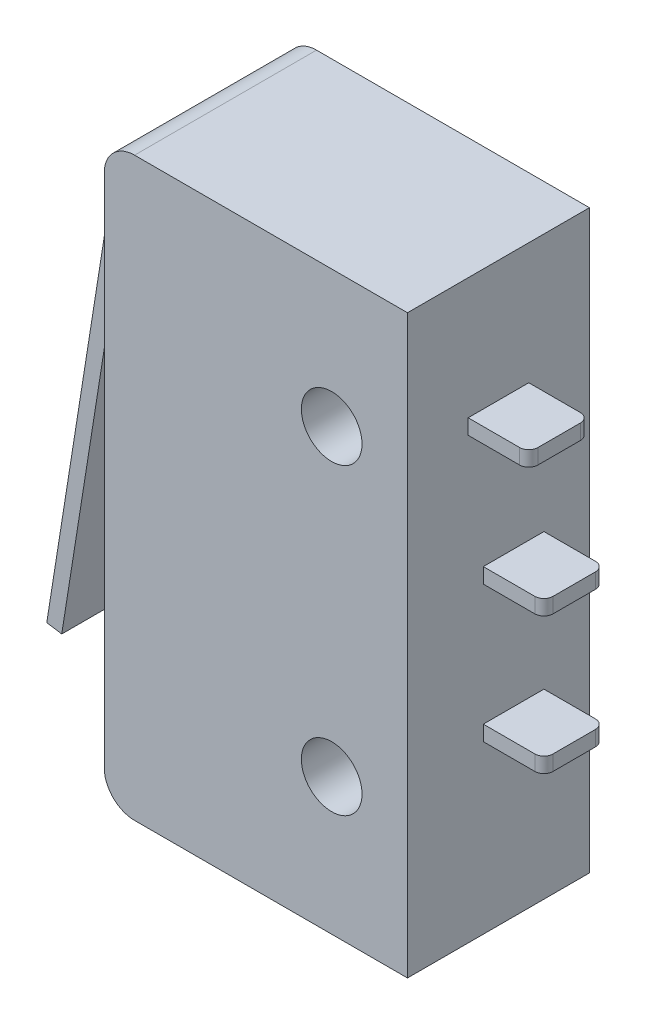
ISO-10303-21;
HEADER;
FILE_DESCRIPTION(('STEP AP214'),'2;1');
FILE_NAME('part.step','',(''),(''),'','','');
FILE_SCHEMA(('AUTOMOTIVE_DESIGN { 1 0 10303 214 1 1 1 1 }'));
ENDSEC;
DATA;
#1=APPLICATION_CONTEXT('core data for automotive mechanical design processes');
#2=APPLICATION_PROTOCOL_DEFINITION('international standard','automotive_design',2000,#1);
#3=PRODUCT_CONTEXT('',#1,'mechanical');
#4=PRODUCT('Part','Part','',(#3));
#5=PRODUCT_RELATED_PRODUCT_CATEGORY('part','',(#4));
#6=PRODUCT_DEFINITION_FORMATION('','',#4);
#7=PRODUCT_DEFINITION_CONTEXT('part definition',#1,'design');
#8=PRODUCT_DEFINITION('design','',#6,#7);
#9=PRODUCT_DEFINITION_SHAPE('','',#8);
#10=(LENGTH_UNIT() NAMED_UNIT(*) SI_UNIT(.MILLI.,.METRE.));
#11=(NAMED_UNIT(*) PLANE_ANGLE_UNIT() SI_UNIT($,.RADIAN.));
#12=(NAMED_UNIT(*) SI_UNIT($,.STERADIAN.) SOLID_ANGLE_UNIT());
#13=UNCERTAINTY_MEASURE_WITH_UNIT(LENGTH_MEASURE(1.E-05),#10,'distance_accuracy_value','');
#14=(GEOMETRIC_REPRESENTATION_CONTEXT(3) GLOBAL_UNCERTAINTY_ASSIGNED_CONTEXT((#13)) GLOBAL_UNIT_ASSIGNED_CONTEXT((#10,
#11,#12)) REPRESENTATION_CONTEXT('',''));
#15=CARTESIAN_POINT('',(0.,0.,0.));
#16=DIRECTION('',(0.,0.,1.));
#17=DIRECTION('',(1.,0.,0.));
#18=AXIS2_PLACEMENT_3D('',#15,#16,#17);
#19=CARTESIAN_POINT('',(-1.79937897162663,16.7666713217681,2.25));
#20=DIRECTION('',(-0.987688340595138,0.156434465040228,0.));
#21=DIRECTION('',(0.,0.,1.));
#22=AXIS2_PLACEMENT_3D('',#19,#20,#21);
#23=PLANE('',#22);
#24=DIRECTION('',(0.156434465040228,0.987688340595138,0.));
#25=VECTOR('',#24,1.);
#26=CARTESIAN_POINT('',(-1.79937897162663,16.7666713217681,3.75));
#27=LINE('',#26,#25);
#28=CARTESIAN_POINT('',(-4.14589594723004,1.95134621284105,3.74999999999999));
#29=VERTEX_POINT('',#28);
#30=CARTESIAN_POINT('',(-2.16521922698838,14.4568468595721,3.75));
#31=VERTEX_POINT('',#30);
#32=EDGE_CURVE('E46',#29,#31,#27,.T.);
#33=ORIENTED_EDGE('',*,*,#32,.T.);
#34=DIRECTION('',(0.,0.,-1.));
#35=VECTOR('',#34,1.);
#36=CARTESIAN_POINT('',(-2.16521922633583,14.4568468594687,2.25));
#37=LINE('',#36,#35);
#38=CARTESIAN_POINT('',(-2.16521922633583,14.4568468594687,2.25));
#39=VERTEX_POINT('',#38);
#40=EDGE_CURVE('E119',#31,#39,#37,.T.);
#41=ORIENTED_EDGE('',*,*,#40,.T.);
#42=DIRECTION('',(-0.156434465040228,-0.987688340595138,0.));
#43=VECTOR('',#42,1.);
#44=CARTESIAN_POINT('',(-1.79937897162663,16.7666713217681,2.25));
#45=LINE('',#44,#43);
#46=CARTESIAN_POINT('',(-4.14589594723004,1.95134621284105,2.24999999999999));
#47=VERTEX_POINT('',#46);
#48=EDGE_CURVE('E138',#39,#47,#45,.T.);
#49=ORIENTED_EDGE('',*,*,#48,.T.);
#50=DIRECTION('',(0.,0.,1.));
#51=VECTOR('',#50,1.);
#52=CARTESIAN_POINT('',(-4.14589594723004,1.95134621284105,3.74999999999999));
#53=LINE('',#52,#51);
#54=EDGE_CURVE('E66',#47,#29,#53,.T.);
#55=ORIENTED_EDGE('',*,*,#54,.T.);
#56=EDGE_LOOP('',(#33,#41,#49,#55));
#57=FACE_BOUND('',#56,.T.);
#58=ADVANCED_FACE('F42',(#57),#23,.T.);
#59=CARTESIAN_POINT('',(-1.79937897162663,16.7666713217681,2.25));
#60=DIRECTION('',(0.,0.,1.));
#61=DIRECTION('',(0.156434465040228,0.987688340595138,0.));
#62=AXIS2_PLACEMENT_3D('',#59,#60,#61);
#63=PLANE('',#62);
#64=DIRECTION('',(-0.987688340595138,0.156434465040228,0.));
#65=VECTOR('',#64,1.);
#66=CARTESIAN_POINT('',(-2.16521922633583,14.4568468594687,2.25));
#67=LINE('',#66,#65);
#68=CARTESIAN_POINT('',(-1.67137505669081,14.378629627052,2.25));
#69=VERTEX_POINT('',#68);
#70=EDGE_CURVE('E13',#69,#39,#67,.T.);
#71=ORIENTED_EDGE('',*,*,#70,.F.);
#72=DIRECTION('',(-0.156434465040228,-0.987688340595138,0.));
#73=VECTOR('',#72,1.);
#74=CARTESIAN_POINT('',(-1.30553480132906,16.688454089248,2.25));
#75=LINE('',#74,#73);
#76=CARTESIAN_POINT('',(-3.65205177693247,1.87312898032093,2.24999999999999));
#77=VERTEX_POINT('',#76);
#78=EDGE_CURVE('E143',#69,#77,#75,.T.);
#79=ORIENTED_EDGE('',*,*,#78,.T.);
#80=DIRECTION('',(0.987688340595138,-0.156434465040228,0.));
#81=VECTOR('',#80,1.);
#82=CARTESIAN_POINT('',(-4.14589594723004,1.95134621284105,2.24999999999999));
#83=LINE('',#82,#81);
#84=EDGE_CURVE('E157',#47,#77,#83,.T.);
#85=ORIENTED_EDGE('',*,*,#84,.F.);
#86=ORIENTED_EDGE('',*,*,#48,.F.);
#87=EDGE_LOOP('',(#71,#79,#85,#86));
#88=FACE_BOUND('',#87,.T.);
#89=ADVANCED_FACE('F44',(#88),#63,.F.);
#90=CARTESIAN_POINT('',(-4.14589594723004,1.95134621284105,3.74999999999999));
#91=DIRECTION('',(0.156434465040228,0.987688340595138,0.));
#92=DIRECTION('',(0.,0.,-1.));
#93=AXIS2_PLACEMENT_3D('',#90,#91,#92);
#94=PLANE('',#93);
#95=DIRECTION('',(0.,0.,1.));
#96=VECTOR('',#95,1.);
#97=CARTESIAN_POINT('',(-3.65205177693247,1.87312898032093,3.74999999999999));
#98=LINE('',#97,#96);
#99=CARTESIAN_POINT('',(-3.65205177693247,1.87312898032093,3.74999999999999));
#100=VERTEX_POINT('',#99);
#101=EDGE_CURVE('E139',#77,#100,#98,.T.);
#102=ORIENTED_EDGE('',*,*,#101,.T.);
#103=DIRECTION('',(0.987688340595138,-0.156434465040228,0.));
#104=VECTOR('',#103,1.);
#105=CARTESIAN_POINT('',(-4.14589594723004,1.95134621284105,3.74999999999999));
#106=LINE('',#105,#104);
#107=EDGE_CURVE('E135',#29,#100,#106,.T.);
#108=ORIENTED_EDGE('',*,*,#107,.F.);
#109=ORIENTED_EDGE('',*,*,#54,.F.);
#110=ORIENTED_EDGE('',*,*,#84,.T.);
#111=EDGE_LOOP('',(#102,#108,#109,#110));
#112=FACE_BOUND('',#111,.T.);
#113=ADVANCED_FACE('F161',(#112),#94,.F.);
#114=CARTESIAN_POINT('',(-1.79937897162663,16.7666713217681,3.75));
#115=DIRECTION('',(0.,0.,-1.));
#116=DIRECTION('',(-0.156434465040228,-0.987688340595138,0.));
#117=AXIS2_PLACEMENT_3D('',#114,#115,#116);
#118=PLANE('',#117);
#119=DIRECTION('',(0.987688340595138,-0.156434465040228,0.));
#120=VECTOR('',#119,1.);
#121=CARTESIAN_POINT('',(-2.16521922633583,14.4568468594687,3.75));
#122=LINE('',#121,#120);
#123=CARTESIAN_POINT('',(-1.67137505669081,14.378629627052,3.75));
#124=VERTEX_POINT('',#123);
#125=EDGE_CURVE('E109',#31,#124,#122,.T.);
#126=ORIENTED_EDGE('',*,*,#125,.F.);
#127=ORIENTED_EDGE('',*,*,#32,.F.);
#128=ORIENTED_EDGE('',*,*,#107,.T.);
#129=DIRECTION('',(0.156434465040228,0.987688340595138,0.));
#130=VECTOR('',#129,1.);
#131=CARTESIAN_POINT('',(-1.30553480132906,16.688454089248,3.75));
#132=LINE('',#131,#130);
#133=EDGE_CURVE('E133',#100,#124,#132,.T.);
#134=ORIENTED_EDGE('',*,*,#133,.T.);
#135=EDGE_LOOP('',(#126,#127,#128,#134));
#136=FACE_BOUND('',#135,.T.);
#137=ADVANCED_FACE('F134',(#136),#118,.F.);
#138=CARTESIAN_POINT('',(-1.30553480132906,16.688454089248,2.25));
#139=DIRECTION('',(-0.987688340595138,0.156434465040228,0.));
#140=DIRECTION('',(0.,0.,1.));
#141=AXIS2_PLACEMENT_3D('',#138,#139,#140);
#142=PLANE('',#141);
#143=DIRECTION('',(0.,0.,-1.));
#144=VECTOR('',#143,1.);
#145=CARTESIAN_POINT('',(-1.67137505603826,14.3786296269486,2.25));
#146=LINE('',#145,#144);
#147=EDGE_CURVE('E51',#124,#69,#146,.T.);
#148=ORIENTED_EDGE('',*,*,#147,.F.);
#149=ORIENTED_EDGE('',*,*,#133,.F.);
#150=ORIENTED_EDGE('',*,*,#101,.F.);
#151=ORIENTED_EDGE('',*,*,#78,.F.);
#152=EDGE_LOOP('',(#148,#149,#150,#151));
#153=FACE_BOUND('',#152,.T.);
#154=ADVANCED_FACE('F142',(#153),#142,.F.);
#155=CARTESIAN_POINT('',(0.,15.5,3.75));
#156=DIRECTION('',(-1.,0.,0.));
#157=DIRECTION('',(0.,0.,1.));
#158=AXIS2_PLACEMENT_3D('',#155,#156,#157);
#159=PLANE('',#158);
#160=DIRECTION('',(0.,0.,-1.));
#161=VECTOR('',#160,1.);
#162=CARTESIAN_POINT('',(0.,15.,3.75));
#163=LINE('',#162,#161);
#164=CARTESIAN_POINT('',(0.,15.,3.75));
#165=VERTEX_POINT('',#164);
#166=CARTESIAN_POINT('',(0.,15.,2.25));
#167=VERTEX_POINT('',#166);
#168=EDGE_CURVE('E233',#165,#167,#163,.T.);
#169=ORIENTED_EDGE('',*,*,#168,.T.);
#170=DIRECTION('',(0.,-1.,0.));
#171=VECTOR('',#170,1.);
#172=CARTESIAN_POINT('',(0.,15.5,2.25));
#173=LINE('',#172,#171);
#174=CARTESIAN_POINT('',(0.,15.5,2.25));
#175=VERTEX_POINT('',#174);
#176=EDGE_CURVE('E148',#175,#167,#173,.T.);
#177=ORIENTED_EDGE('',*,*,#176,.F.);
#178=DIRECTION('',(0.,0.,-1.));
#179=VECTOR('',#178,1.);
#180=CARTESIAN_POINT('',(0.,15.5,3.75));
#181=LINE('',#180,#179);
#182=CARTESIAN_POINT('',(0.,15.5,3.75));
#183=VERTEX_POINT('',#182);
#184=EDGE_CURVE('E225',#183,#175,#181,.T.);
#185=ORIENTED_EDGE('',*,*,#184,.F.);
#186=DIRECTION('',(0.,-1.,0.));
#187=VECTOR('',#186,1.);
#188=CARTESIAN_POINT('',(0.,15.5,3.75));
#189=LINE('',#188,#187);
#190=EDGE_CURVE('E230',#183,#165,#189,.T.);
#191=ORIENTED_EDGE('',*,*,#190,.T.);
#192=EDGE_LOOP('',(#169,#177,#185,#191));
#193=FACE_BOUND('',#192,.T.);
#194=ADVANCED_FACE('F175',(#193),#159,.F.);
#195=CARTESIAN_POINT('',(0.,15.5,2.25));
#196=DIRECTION('',(0.,1.,0.));
#197=DIRECTION('',(0.,0.,1.));
#198=AXIS2_PLACEMENT_3D('',#195,#196,#197);
#199=PLANE('',#198);
#200=DIRECTION('',(0.,0.,-1.));
#201=VECTOR('',#200,1.);
#202=CARTESIAN_POINT('',(-0.943843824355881,15.5,2.25));
#203=LINE('',#202,#201);
#204=CARTESIAN_POINT('',(-0.94384382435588,15.500000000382,3.75));
#205=VERTEX_POINT('',#204);
#206=CARTESIAN_POINT('',(-0.94384382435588,15.5000000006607,2.25));
#207=VERTEX_POINT('',#206);
#208=EDGE_CURVE('E234',#205,#207,#203,.T.);
#209=ORIENTED_EDGE('',*,*,#208,.F.);
#210=DIRECTION('',(1.,0.,0.));
#211=VECTOR('',#210,1.);
#212=CARTESIAN_POINT('',(0.,15.5,3.75));
#213=LINE('',#212,#211);
#214=EDGE_CURVE('E228',#205,#183,#213,.T.);
#215=ORIENTED_EDGE('',*,*,#214,.T.);
#216=ORIENTED_EDGE('',*,*,#184,.T.);
#217=DIRECTION('',(-1.,0.,0.));
#218=VECTOR('',#217,1.);
#219=CARTESIAN_POINT('',(0.,15.5,2.25));
#220=LINE('',#219,#218);
#221=EDGE_CURVE('E222',#175,#207,#220,.T.);
#222=ORIENTED_EDGE('',*,*,#221,.T.);
#223=EDGE_LOOP('',(#209,#215,#216,#222));
#224=FACE_BOUND('',#223,.T.);
#225=ADVANCED_FACE('F179',(#224),#199,.T.);
#226=CARTESIAN_POINT('',(0.,15.5,3.75));
#227=DIRECTION('',(0.,0.,-1.));
#228=DIRECTION('',(-1.,0.,0.));
#229=AXIS2_PLACEMENT_3D('',#226,#227,#228);
#230=PLANE('',#229);
#231=ORIENTED_EDGE('',*,*,#214,.F.);
#232=DIRECTION('',(0.,-1.,0.));
#233=VECTOR('',#232,1.);
#234=CARTESIAN_POINT('',(-0.943843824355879,15.5,3.75));
#235=LINE('',#234,#233);
#236=CARTESIAN_POINT('',(-0.94384382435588,15.,3.75));
#237=VERTEX_POINT('',#236);
#238=EDGE_CURVE('E217',#205,#237,#235,.T.);
#239=ORIENTED_EDGE('',*,*,#238,.T.);
#240=DIRECTION('',(1.,0.,0.));
#241=VECTOR('',#240,1.);
#242=CARTESIAN_POINT('',(0.,15.,3.75));
#243=LINE('',#242,#241);
#244=EDGE_CURVE('E214',#237,#165,#243,.T.);
#245=ORIENTED_EDGE('',*,*,#244,.T.);
#246=ORIENTED_EDGE('',*,*,#190,.F.);
#247=EDGE_LOOP('',(#231,#239,#245,#246));
#248=FACE_BOUND('',#247,.T.);
#249=ADVANCED_FACE('F185',(#248),#230,.F.);
#250=CARTESIAN_POINT('',(0.,15.,2.25));
#251=DIRECTION('',(0.,1.,0.));
#252=DIRECTION('',(0.,0.,1.));
#253=AXIS2_PLACEMENT_3D('',#250,#251,#252);
#254=PLANE('',#253);
#255=ORIENTED_EDGE('',*,*,#244,.F.);
#256=DIRECTION('',(0.,0.,-1.));
#257=VECTOR('',#256,1.);
#258=CARTESIAN_POINT('',(-0.943843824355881,15.,2.25));
#259=LINE('',#258,#257);
#260=CARTESIAN_POINT('',(-0.94384382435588,15.0000000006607,2.25));
#261=VERTEX_POINT('',#260);
#262=EDGE_CURVE('E127',#237,#261,#259,.T.);
#263=ORIENTED_EDGE('',*,*,#262,.T.);
#264=DIRECTION('',(-1.,0.,0.));
#265=VECTOR('',#264,1.);
#266=CARTESIAN_POINT('',(0.,15.,2.25));
#267=LINE('',#266,#265);
#268=EDGE_CURVE('E209',#167,#261,#267,.T.);
#269=ORIENTED_EDGE('',*,*,#268,.F.);
#270=ORIENTED_EDGE('',*,*,#168,.F.);
#271=EDGE_LOOP('',(#255,#263,#269,#270));
#272=FACE_BOUND('',#271,.T.);
#273=ADVANCED_FACE('F195',(#272),#254,.F.);
#274=CARTESIAN_POINT('',(0.,15.5,2.25));
#275=DIRECTION('',(0.,0.,1.));
#276=DIRECTION('',(1.,0.,0.));
#277=AXIS2_PLACEMENT_3D('',#274,#275,#276);
#278=PLANE('',#277);
#279=ORIENTED_EDGE('',*,*,#268,.T.);
#280=DIRECTION('',(0.,1.,0.));
#281=VECTOR('',#280,1.);
#282=CARTESIAN_POINT('',(-0.943843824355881,15.5,2.25));
#283=LINE('',#282,#281);
#284=EDGE_CURVE('E210',#261,#207,#283,.T.);
#285=ORIENTED_EDGE('',*,*,#284,.T.);
#286=ORIENTED_EDGE('',*,*,#221,.F.);
#287=ORIENTED_EDGE('',*,*,#176,.T.);
#288=EDGE_LOOP('',(#279,#285,#286,#287));
#289=FACE_BOUND('',#288,.T.);
#290=ADVANCED_FACE('F198',(#289),#278,.F.);
#291=CARTESIAN_POINT('',(-0.943843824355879,14.2633999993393,3.75));
#292=DIRECTION('',(0.,0.,1.));
#293=DIRECTION('',(1.,0.,0.));
#294=AXIS2_PLACEMENT_3D('',#291,#292,#293);
#295=PLANE('',#294);
#296=ORIENTED_EDGE('',*,*,#125,.T.);
#297=CARTESIAN_POINT('',(-0.943843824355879,14.2634,3.75));
#298=DIRECTION('',(0.,0.,1.));
#299=DIRECTION('',(1.,0.,0.));
#300=AXIS2_PLACEMENT_3D('',#297,#298,#299);
#301=CIRCLE('',#300,0.736600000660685);
#302=EDGE_CURVE('E112',#124,#237,#301,.F.);
#303=ORIENTED_EDGE('',*,*,#302,.T.);
#304=ORIENTED_EDGE('',*,*,#238,.F.);
#305=CARTESIAN_POINT('',(-0.943843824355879,14.2633999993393,3.75));
#306=DIRECTION('',(0.,0.,-1.));
#307=DIRECTION('',(-1.,0.,0.));
#308=AXIS2_PLACEMENT_3D('',#305,#306,#307);
#309=CIRCLE('',#308,1.2366000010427);
#310=EDGE_CURVE('E115',#31,#205,#309,.T.);
#311=ORIENTED_EDGE('',*,*,#310,.F.);
#312=EDGE_LOOP('',(#296,#303,#304,#311));
#313=FACE_BOUND('',#312,.T.);
#314=ADVANCED_FACE('F111',(#313),#295,.T.);
#315=CARTESIAN_POINT('',(-0.943843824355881,14.2633999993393,2.25));
#316=DIRECTION('',(0.,0.,-1.));
#317=DIRECTION('',(-1.,0.,0.));
#318=AXIS2_PLACEMENT_3D('',#315,#316,#317);
#319=PLANE('',#318);
#320=CARTESIAN_POINT('',(-0.943843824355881,14.2634,2.25));
#321=DIRECTION('',(0.,0.,1.));
#322=DIRECTION('',(1.,0.,0.));
#323=AXIS2_PLACEMENT_3D('',#320,#321,#322);
#324=CIRCLE('',#323,0.736600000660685);
#325=EDGE_CURVE('E129',#261,#69,#324,.T.);
#326=ORIENTED_EDGE('',*,*,#325,.T.);
#327=ORIENTED_EDGE('',*,*,#70,.T.);
#328=CARTESIAN_POINT('',(-0.943843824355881,14.2633999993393,2.25));
#329=DIRECTION('',(0.,0.,1.));
#330=DIRECTION('',(1.,0.,0.));
#331=AXIS2_PLACEMENT_3D('',#328,#329,#330);
#332=CIRCLE('',#331,1.2366000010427);
#333=EDGE_CURVE('E59',#207,#39,#332,.T.);
#334=ORIENTED_EDGE('',*,*,#333,.F.);
#335=ORIENTED_EDGE('',*,*,#284,.F.);
#336=EDGE_LOOP('',(#326,#327,#334,#335));
#337=FACE_BOUND('',#336,.T.);
#338=ADVANCED_FACE('F190',(#337),#319,.T.);
#339=CARTESIAN_POINT('',(-0.943843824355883,14.2634,0.891590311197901));
#340=DIRECTION('',(0.,0.,1.));
#341=DIRECTION('',(1.,0.,0.));
#342=AXIS2_PLACEMENT_3D('',#339,#340,#341);
#343=CYLINDRICAL_SURFACE('',#342,1.23660000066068);
#344=ORIENTED_EDGE('',*,*,#208,.T.);
#345=ORIENTED_EDGE('',*,*,#333,.T.);
#346=ORIENTED_EDGE('',*,*,#40,.F.);
#347=ORIENTED_EDGE('',*,*,#310,.T.);
#348=EDGE_LOOP('',(#344,#345,#346,#347));
#349=FACE_BOUND('',#348,.T.);
#350=ADVANCED_FACE('F205',(#349),#343,.T.);
#351=CARTESIAN_POINT('',(-0.943843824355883,14.2634,0.891590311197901));
#352=DIRECTION('',(0.,0.,1.));
#353=DIRECTION('',(1.,0.,0.));
#354=AXIS2_PLACEMENT_3D('',#351,#352,#353);
#355=CYLINDRICAL_SURFACE('',#354,0.736600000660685);
#356=ORIENTED_EDGE('',*,*,#262,.F.);
#357=ORIENTED_EDGE('',*,*,#302,.F.);
#358=ORIENTED_EDGE('',*,*,#147,.T.);
#359=ORIENTED_EDGE('',*,*,#325,.F.);
#360=EDGE_LOOP('',(#356,#357,#358,#359));
#361=FACE_BOUND('',#360,.T.);
#362=ADVANCED_FACE('F122',(#361),#355,.F.);
#363=CLOSED_SHELL('',(#58,#89,#113,#137,#154,#194,#225,#249,#273,#290,#314,#338,#350,#362));
#364=MANIFOLD_SOLID_BREP('B2',#363);
#365=CARTESIAN_POINT('',(10.,0.,6.));
#366=DIRECTION('',(-1.,0.,0.));
#367=DIRECTION('',(0.,-1.,0.));
#368=AXIS2_PLACEMENT_3D('',#365,#366,#367);
#369=PLANE('',#368);
#370=DIRECTION('',(0.,-1.,0.));
#371=VECTOR('',#370,1.);
#372=CARTESIAN_POINT('',(10.,10.5,3.5));
#373=LINE('',#372,#371);
#374=CARTESIAN_POINT('',(10.,10.5,3.5));
#375=VERTEX_POINT('',#374);
#376=CARTESIAN_POINT('',(10.,10.,3.5));
#377=VERTEX_POINT('',#376);
#378=EDGE_CURVE('E526',#375,#377,#373,.T.);
#379=ORIENTED_EDGE('',*,*,#378,.F.);
#380=DIRECTION('',(0.,0.,1.));
#381=VECTOR('',#380,1.);
#382=CARTESIAN_POINT('',(10.,10.5,3.5));
#383=LINE('',#382,#381);
#384=CARTESIAN_POINT('',(10.,10.5,1.5));
#385=VERTEX_POINT('',#384);
#386=EDGE_CURVE('E535',#385,#375,#383,.T.);
#387=ORIENTED_EDGE('',*,*,#386,.F.);
#388=DIRECTION('',(0.,1.,0.));
#389=VECTOR('',#388,1.);
#390=CARTESIAN_POINT('',(10.,10.5,1.5));
#391=LINE('',#390,#389);
#392=CARTESIAN_POINT('',(10.,10.,1.5));
#393=VERTEX_POINT('',#392);
#394=EDGE_CURVE('E532',#393,#385,#391,.T.);
#395=ORIENTED_EDGE('',*,*,#394,.F.);
#396=DIRECTION('',(0.,0.,-1.));
#397=VECTOR('',#396,1.);
#398=CARTESIAN_POINT('',(10.,10.,3.5));
#399=LINE('',#398,#397);
#400=EDGE_CURVE('E529',#377,#393,#399,.T.);
#401=ORIENTED_EDGE('',*,*,#400,.F.);
#402=EDGE_LOOP('',(#379,#387,#395,#401));
#403=FACE_BOUND('',#402,.T.);
#404=DIRECTION('',(0.,1.,0.));
#405=VECTOR('',#404,1.);
#406=CARTESIAN_POINT('',(10.,0.,0.));
#407=LINE('',#406,#405);
#408=CARTESIAN_POINT('',(10.,0.,0.));
#409=VERTEX_POINT('',#408);
#410=CARTESIAN_POINT('',(10.,19.,0.));
#411=VERTEX_POINT('',#410);
#412=EDGE_CURVE('E595',#409,#411,#407,.T.);
#413=ORIENTED_EDGE('',*,*,#412,.T.);
#414=DIRECTION('',(0.,0.,-1.));
#415=VECTOR('',#414,1.);
#416=CARTESIAN_POINT('',(10.,19.,6.));
#417=LINE('',#416,#415);
#418=CARTESIAN_POINT('',(10.,19.,6.));
#419=VERTEX_POINT('',#418);
#420=EDGE_CURVE('E610',#419,#411,#417,.T.);
#421=ORIENTED_EDGE('',*,*,#420,.F.);
#422=DIRECTION('',(0.,1.,0.));
#423=VECTOR('',#422,1.);
#424=CARTESIAN_POINT('',(10.,0.,6.));
#425=LINE('',#424,#423);
#426=CARTESIAN_POINT('',(10.,0.,6.));
#427=VERTEX_POINT('',#426);
#428=EDGE_CURVE('E605',#427,#419,#425,.T.);
#429=ORIENTED_EDGE('',*,*,#428,.F.);
#430=DIRECTION('',(0.,0.,-1.));
#431=VECTOR('',#430,1.);
#432=CARTESIAN_POINT('',(10.,0.,6.));
#433=LINE('',#432,#431);
#434=EDGE_CURVE('E613',#427,#409,#433,.T.);
#435=ORIENTED_EDGE('',*,*,#434,.T.);
#436=EDGE_LOOP('',(#413,#421,#429,#435));
#437=FACE_BOUND('',#436,.T.);
#438=DIRECTION('',(0.,-1.,0.));
#439=VECTOR('',#438,1.);
#440=CARTESIAN_POINT('',(10.,15.,4.));
#441=LINE('',#440,#439);
#442=CARTESIAN_POINT('',(10.,15.,4.));
#443=VERTEX_POINT('',#442);
#444=CARTESIAN_POINT('',(10.,14.5,4.));
#445=VERTEX_POINT('',#444);
#446=EDGE_CURVE('E552',#443,#445,#441,.T.);
#447=ORIENTED_EDGE('',*,*,#446,.F.);
#448=DIRECTION('',(0.,0.,1.));
#449=VECTOR('',#448,1.);
#450=CARTESIAN_POINT('',(10.,15.,4.));
#451=LINE('',#450,#449);
#452=CARTESIAN_POINT('',(10.,15.,2.));
#453=VERTEX_POINT('',#452);
#454=EDGE_CURVE('E561',#453,#443,#451,.T.);
#455=ORIENTED_EDGE('',*,*,#454,.F.);
#456=DIRECTION('',(0.,1.,0.));
#457=VECTOR('',#456,1.);
#458=CARTESIAN_POINT('',(10.,15.,2.));
#459=LINE('',#458,#457);
#460=CARTESIAN_POINT('',(10.,14.5,2.));
#461=VERTEX_POINT('',#460);
#462=EDGE_CURVE('E558',#461,#453,#459,.T.);
#463=ORIENTED_EDGE('',*,*,#462,.F.);
#464=DIRECTION('',(0.,0.,-1.));
#465=VECTOR('',#464,1.);
#466=CARTESIAN_POINT('',(10.,14.5,4.));
#467=LINE('',#466,#465);
#468=EDGE_CURVE('E555',#445,#461,#467,.T.);
#469=ORIENTED_EDGE('',*,*,#468,.F.);
#470=EDGE_LOOP('',(#447,#455,#463,#469));
#471=FACE_BOUND('',#470,.T.);
#472=DIRECTION('',(0.,-1.,0.));
#473=VECTOR('',#472,1.);
#474=CARTESIAN_POINT('',(10.,6.,3.5));
#475=LINE('',#474,#473);
#476=CARTESIAN_POINT('',(10.,6.,3.5));
#477=VERTEX_POINT('',#476);
#478=CARTESIAN_POINT('',(10.,5.5,3.5));
#479=VERTEX_POINT('',#478);
#480=EDGE_CURVE('E490',#477,#479,#475,.T.);
#481=ORIENTED_EDGE('',*,*,#480,.F.);
#482=DIRECTION('',(0.,0.,1.));
#483=VECTOR('',#482,1.);
#484=CARTESIAN_POINT('',(10.,6.,3.5));
#485=LINE('',#484,#483);
#486=CARTESIAN_POINT('',(10.,6.,1.5));
#487=VERTEX_POINT('',#486);
#488=EDGE_CURVE('E503',#487,#477,#485,.T.);
#489=ORIENTED_EDGE('',*,*,#488,.F.);
#490=DIRECTION('',(0.,1.,0.));
#491=VECTOR('',#490,1.);
#492=CARTESIAN_POINT('',(10.,6.,1.5));
#493=LINE('',#492,#491);
#494=CARTESIAN_POINT('',(10.,5.5,1.5));
#495=VERTEX_POINT('',#494);
#496=EDGE_CURVE('E512',#495,#487,#493,.T.);
#497=ORIENTED_EDGE('',*,*,#496,.F.);
#498=DIRECTION('',(0.,0.,-1.));
#499=VECTOR('',#498,1.);
#500=CARTESIAN_POINT('',(10.,5.5,3.5));
#501=LINE('',#500,#499);
#502=EDGE_CURVE('E506',#479,#495,#501,.T.);
#503=ORIENTED_EDGE('',*,*,#502,.F.);
#504=EDGE_LOOP('',(#481,#489,#497,#503));
#505=FACE_BOUND('',#504,.T.);
#506=ADVANCED_FACE('F325',(#403,#437,#471,#505),#369,.F.);
#507=CARTESIAN_POINT('',(0.,0.,6.));
#508=DIRECTION('',(1.,0.,0.));
#509=DIRECTION('',(0.,0.,-1.));
#510=AXIS2_PLACEMENT_3D('',#507,#508,#509);
#511=PLANE('',#510);
#512=DIRECTION('',(0.,-1.,0.));
#513=VECTOR('',#512,1.);
#514=CARTESIAN_POINT('',(0.,0.,0.));
#515=LINE('',#514,#513);
#516=CARTESIAN_POINT('',(0.,18.,0.));
#517=VERTEX_POINT('',#516);
#518=CARTESIAN_POINT('',(0.,1.,0.));
#519=VERTEX_POINT('',#518);
#520=EDGE_CURVE('E590',#517,#519,#515,.T.);
#521=ORIENTED_EDGE('',*,*,#520,.T.);
#522=DIRECTION('',(0.,0.,-1.));
#523=VECTOR('',#522,1.);
#524=CARTESIAN_POINT('',(0.,1.,6.));
#525=LINE('',#524,#523);
#526=CARTESIAN_POINT('',(0.,1.,6.));
#527=VERTEX_POINT('',#526);
#528=EDGE_CURVE('E626',#519,#527,#525,.F.);
#529=ORIENTED_EDGE('',*,*,#528,.T.);
#530=DIRECTION('',(0.,-1.,0.));
#531=VECTOR('',#530,1.);
#532=CARTESIAN_POINT('',(0.,0.,6.));
#533=LINE('',#532,#531);
#534=CARTESIAN_POINT('',(0.,18.,6.));
#535=VERTEX_POINT('',#534);
#536=EDGE_CURVE('E600',#535,#527,#533,.T.);
#537=ORIENTED_EDGE('',*,*,#536,.F.);
#538=DIRECTION('',(0.,0.,-1.));
#539=VECTOR('',#538,1.);
#540=CARTESIAN_POINT('',(0.,18.,6.));
#541=LINE('',#540,#539);
#542=EDGE_CURVE('E623',#535,#517,#541,.T.);
#543=ORIENTED_EDGE('',*,*,#542,.T.);
#544=EDGE_LOOP('',(#521,#529,#537,#543));
#545=FACE_BOUND('',#544,.T.);
#546=ADVANCED_FACE('F327',(#545),#511,.F.);
#547=CARTESIAN_POINT('',(0.,0.,6.));
#548=DIRECTION('',(0.,1.,0.));
#549=DIRECTION('',(0.,0.,1.));
#550=AXIS2_PLACEMENT_3D('',#547,#548,#549);
#551=PLANE('',#550);
#552=DIRECTION('',(1.,0.,0.));
#553=VECTOR('',#552,1.);
#554=CARTESIAN_POINT('',(0.,0.,6.));
#555=LINE('',#554,#553);
#556=CARTESIAN_POINT('',(1.,0.,6.));
#557=VERTEX_POINT('',#556);
#558=EDGE_CURVE('E603',#557,#427,#555,.T.);
#559=ORIENTED_EDGE('',*,*,#558,.F.);
#560=DIRECTION('',(0.,0.,-1.));
#561=VECTOR('',#560,1.);
#562=CARTESIAN_POINT('',(1.,0.,6.));
#563=LINE('',#562,#561);
#564=CARTESIAN_POINT('',(1.,0.,0.));
#565=VERTEX_POINT('',#564);
#566=EDGE_CURVE('E616',#557,#565,#563,.T.);
#567=ORIENTED_EDGE('',*,*,#566,.T.);
#568=DIRECTION('',(1.,0.,0.));
#569=VECTOR('',#568,1.);
#570=CARTESIAN_POINT('',(0.,0.,0.));
#571=LINE('',#570,#569);
#572=EDGE_CURVE('E593',#565,#409,#571,.T.);
#573=ORIENTED_EDGE('',*,*,#572,.T.);
#574=ORIENTED_EDGE('',*,*,#434,.F.);
#575=EDGE_LOOP('',(#559,#567,#573,#574));
#576=FACE_BOUND('',#575,.T.);
#577=ADVANCED_FACE('F719',(#576),#551,.F.);
#578=CARTESIAN_POINT('',(0.,19.,6.));
#579=DIRECTION('',(0.,-1.,0.));
#580=DIRECTION('',(0.,0.,-1.));
#581=AXIS2_PLACEMENT_3D('',#578,#579,#580);
#582=PLANE('',#581);
#583=DIRECTION('',(-1.,0.,0.));
#584=VECTOR('',#583,1.);
#585=CARTESIAN_POINT('',(0.,19.,0.));
#586=LINE('',#585,#584);
#587=CARTESIAN_POINT('',(1.,19.,0.));
#588=VERTEX_POINT('',#587);
#589=EDGE_CURVE('E597',#411,#588,#586,.T.);
#590=ORIENTED_EDGE('',*,*,#589,.T.);
#591=DIRECTION('',(0.,0.,-1.));
#592=VECTOR('',#591,1.);
#593=CARTESIAN_POINT('',(1.,19.,6.));
#594=LINE('',#593,#592);
#595=CARTESIAN_POINT('',(1.,19.,6.));
#596=VERTEX_POINT('',#595);
#597=EDGE_CURVE('E632',#588,#596,#594,.F.);
#598=ORIENTED_EDGE('',*,*,#597,.T.);
#599=DIRECTION('',(-1.,0.,0.));
#600=VECTOR('',#599,1.);
#601=CARTESIAN_POINT('',(0.,19.,6.));
#602=LINE('',#601,#600);
#603=EDGE_CURVE('E607',#419,#596,#602,.T.);
#604=ORIENTED_EDGE('',*,*,#603,.F.);
#605=ORIENTED_EDGE('',*,*,#420,.T.);
#606=EDGE_LOOP('',(#590,#598,#604,#605));
#607=FACE_BOUND('',#606,.T.);
#608=ADVANCED_FACE('F724',(#607),#582,.F.);
#609=CARTESIAN_POINT('',(0.,19.,6.));
#610=DIRECTION('',(0.,0.,-1.));
#611=DIRECTION('',(-1.,0.,0.));
#612=AXIS2_PLACEMENT_3D('',#609,#610,#611);
#613=PLANE('',#612);
#614=CARTESIAN_POINT('',(7.5,4.5,6.));
#615=DIRECTION('',(0.,0.,1.));
#616=DIRECTION('',(1.,0.,0.));
#617=AXIS2_PLACEMENT_3D('',#614,#615,#616);
#618=CIRCLE('',#617,1.);
#619=CARTESIAN_POINT('',(8.5,4.5,6.));
#620=VERTEX_POINT('',#619);
#621=EDGE_CURVE('E578',#620,#620,#618,.T.);
#622=ORIENTED_EDGE('',*,*,#621,.F.);
#623=EDGE_LOOP('',(#622));
#624=FACE_BOUND('',#623,.T.);
#625=CARTESIAN_POINT('',(7.5,14.5,6.));
#626=DIRECTION('',(0.,0.,1.));
#627=DIRECTION('',(1.,0.,0.));
#628=AXIS2_PLACEMENT_3D('',#625,#626,#627);
#629=CIRCLE('',#628,0.999999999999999);
#630=CARTESIAN_POINT('',(8.5,14.5,6.));
#631=VERTEX_POINT('',#630);
#632=EDGE_CURVE('E584',#631,#631,#629,.T.);
#633=ORIENTED_EDGE('',*,*,#632,.F.);
#634=EDGE_LOOP('',(#633));
#635=FACE_BOUND('',#634,.T.);
#636=ORIENTED_EDGE('',*,*,#536,.T.);
#637=CARTESIAN_POINT('',(1.,1.,6.));
#638=DIRECTION('',(0.,0.,-1.));
#639=DIRECTION('',(-1.,0.,0.));
#640=AXIS2_PLACEMENT_3D('',#637,#638,#639);
#641=CIRCLE('',#640,1.);
#642=EDGE_CURVE('E630',#527,#557,#641,.F.);
#643=ORIENTED_EDGE('',*,*,#642,.T.);
#644=ORIENTED_EDGE('',*,*,#558,.T.);
#645=ORIENTED_EDGE('',*,*,#428,.T.);
#646=ORIENTED_EDGE('',*,*,#603,.T.);
#647=CARTESIAN_POINT('',(1.,18.,6.));
#648=DIRECTION('',(0.,0.,-1.));
#649=DIRECTION('',(-1.,0.,0.));
#650=AXIS2_PLACEMENT_3D('',#647,#648,#649);
#651=CIRCLE('',#650,1.);
#652=EDGE_CURVE('E628',#596,#535,#651,.F.);
#653=ORIENTED_EDGE('',*,*,#652,.T.);
#654=EDGE_LOOP('',(#636,#643,#644,#645,#646,#653));
#655=FACE_BOUND('',#654,.T.);
#656=ADVANCED_FACE('F731',(#624,#635,#655),#613,.F.);
#657=CARTESIAN_POINT('',(0.,19.,0.));
#658=DIRECTION('',(0.,0.,-1.));
#659=DIRECTION('',(-1.,0.,0.));
#660=AXIS2_PLACEMENT_3D('',#657,#658,#659);
#661=PLANE('',#660);
#662=CARTESIAN_POINT('',(7.5,4.5,0.));
#663=DIRECTION('',(0.,0.,1.));
#664=DIRECTION('',(1.,0.,0.));
#665=AXIS2_PLACEMENT_3D('',#662,#663,#664);
#666=CIRCLE('',#665,1.);
#667=CARTESIAN_POINT('',(8.5,4.5,0.));
#668=VERTEX_POINT('',#667);
#669=EDGE_CURVE('E581',#668,#668,#666,.T.);
#670=ORIENTED_EDGE('',*,*,#669,.T.);
#671=EDGE_LOOP('',(#670));
#672=FACE_BOUND('',#671,.T.);
#673=CARTESIAN_POINT('',(7.5,14.5,0.));
#674=DIRECTION('',(0.,0.,1.));
#675=DIRECTION('',(1.,0.,0.));
#676=AXIS2_PLACEMENT_3D('',#673,#674,#675);
#677=CIRCLE('',#676,0.999999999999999);
#678=CARTESIAN_POINT('',(8.5,14.5,0.));
#679=VERTEX_POINT('',#678);
#680=EDGE_CURVE('E587',#679,#679,#677,.T.);
#681=ORIENTED_EDGE('',*,*,#680,.T.);
#682=EDGE_LOOP('',(#681));
#683=FACE_BOUND('',#682,.T.);
#684=ORIENTED_EDGE('',*,*,#572,.F.);
#685=CARTESIAN_POINT('',(1.,1.,0.));
#686=DIRECTION('',(0.,0.,-1.));
#687=DIRECTION('',(-1.,0.,0.));
#688=AXIS2_PLACEMENT_3D('',#685,#686,#687);
#689=CIRCLE('',#688,1.);
#690=EDGE_CURVE('E621',#565,#519,#689,.T.);
#691=ORIENTED_EDGE('',*,*,#690,.T.);
#692=ORIENTED_EDGE('',*,*,#520,.F.);
#693=CARTESIAN_POINT('',(1.,18.,0.));
#694=DIRECTION('',(0.,0.,-1.));
#695=DIRECTION('',(-1.,0.,0.));
#696=AXIS2_PLACEMENT_3D('',#693,#694,#695);
#697=CIRCLE('',#696,1.);
#698=EDGE_CURVE('E619',#517,#588,#697,.T.);
#699=ORIENTED_EDGE('',*,*,#698,.T.);
#700=ORIENTED_EDGE('',*,*,#589,.F.);
#701=ORIENTED_EDGE('',*,*,#412,.F.);
#702=EDGE_LOOP('',(#684,#691,#692,#699,#700,#701));
#703=FACE_BOUND('',#702,.T.);
#704=ADVANCED_FACE('F745',(#672,#683,#703),#661,.T.);
#705=CARTESIAN_POINT('',(1.,1.,6.));
#706=DIRECTION('',(0.,0.,-1.));
#707=DIRECTION('',(-1.,0.,0.));
#708=AXIS2_PLACEMENT_3D('',#705,#706,#707);
#709=CYLINDRICAL_SURFACE('',#708,1.);
#710=ORIENTED_EDGE('',*,*,#642,.F.);
#711=ORIENTED_EDGE('',*,*,#528,.F.);
#712=ORIENTED_EDGE('',*,*,#690,.F.);
#713=ORIENTED_EDGE('',*,*,#566,.F.);
#714=EDGE_LOOP('',(#710,#711,#712,#713));
#715=FACE_BOUND('',#714,.T.);
#716=ADVANCED_FACE('F741',(#715),#709,.T.);
#717=CARTESIAN_POINT('',(1.,18.,6.));
#718=DIRECTION('',(0.,0.,-1.));
#719=DIRECTION('',(-1.,0.,0.));
#720=AXIS2_PLACEMENT_3D('',#717,#718,#719);
#721=CYLINDRICAL_SURFACE('',#720,1.);
#722=ORIENTED_EDGE('',*,*,#652,.F.);
#723=ORIENTED_EDGE('',*,*,#597,.F.);
#724=ORIENTED_EDGE('',*,*,#698,.F.);
#725=ORIENTED_EDGE('',*,*,#542,.F.);
#726=EDGE_LOOP('',(#722,#723,#724,#725));
#727=FACE_BOUND('',#726,.T.);
#728=ADVANCED_FACE('F751',(#727),#721,.T.);
#729=CARTESIAN_POINT('',(7.5,14.5,0.));
#730=DIRECTION('',(0.,0.,1.));
#731=DIRECTION('',(1.,0.,0.));
#732=AXIS2_PLACEMENT_3D('',#729,#730,#731);
#733=CYLINDRICAL_SURFACE('',#732,0.999999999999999);
#734=ORIENTED_EDGE('',*,*,#680,.F.);
#735=EDGE_LOOP('',(#734));
#736=FACE_BOUND('',#735,.T.);
#737=ORIENTED_EDGE('',*,*,#632,.T.);
#738=EDGE_LOOP('',(#737));
#739=FACE_BOUND('',#738,.T.);
#740=ADVANCED_FACE('F770',(#736,#739),#733,.F.);
#741=CARTESIAN_POINT('',(7.5,4.5,0.));
#742=DIRECTION('',(0.,0.,1.));
#743=DIRECTION('',(1.,0.,0.));
#744=AXIS2_PLACEMENT_3D('',#741,#742,#743);
#745=CYLINDRICAL_SURFACE('',#744,1.);
#746=ORIENTED_EDGE('',*,*,#669,.F.);
#747=EDGE_LOOP('',(#746));
#748=FACE_BOUND('',#747,.T.);
#749=ORIENTED_EDGE('',*,*,#621,.T.);
#750=EDGE_LOOP('',(#749));
#751=FACE_BOUND('',#750,.T.);
#752=ADVANCED_FACE('F773',(#748,#751),#745,.F.);
#753=CARTESIAN_POINT('',(12.,15.,4.));
#754=DIRECTION('',(0.,0.,-1.));
#755=DIRECTION('',(-1.,0.,0.));
#756=AXIS2_PLACEMENT_3D('',#753,#754,#755);
#757=PLANE('',#756);
#758=DIRECTION('',(-1.,0.,0.));
#759=VECTOR('',#758,1.);
#760=CARTESIAN_POINT('',(12.,14.5,4.));
#761=LINE('',#760,#759);
#762=CARTESIAN_POINT('',(11.7,14.5,4.));
#763=VERTEX_POINT('',#762);
#764=EDGE_CURVE('E576',#763,#445,#761,.T.);
#765=ORIENTED_EDGE('',*,*,#764,.F.);
#766=DIRECTION('',(0.,-1.,0.));
#767=VECTOR('',#766,1.);
#768=CARTESIAN_POINT('',(11.7,15.,4.));
#769=LINE('',#768,#767);
#770=CARTESIAN_POINT('',(11.7,15.,4.));
#771=VERTEX_POINT('',#770);
#772=EDGE_CURVE('E40',#763,#771,#769,.F.);
#773=ORIENTED_EDGE('',*,*,#772,.T.);
#774=DIRECTION('',(-1.,0.,0.));
#775=VECTOR('',#774,1.);
#776=CARTESIAN_POINT('',(12.,15.,4.));
#777=LINE('',#776,#775);
#778=EDGE_CURVE('E570',#771,#443,#777,.T.);
#779=ORIENTED_EDGE('',*,*,#778,.T.);
#780=ORIENTED_EDGE('',*,*,#446,.T.);
#781=EDGE_LOOP('',(#765,#773,#779,#780));
#782=FACE_BOUND('',#781,.T.);
#783=ADVANCED_FACE('F699',(#782),#757,.F.);
#784=CARTESIAN_POINT('',(12.,14.5,4.));
#785=DIRECTION('',(0.,1.,0.));
#786=DIRECTION('',(-1.,0.,0.));
#787=AXIS2_PLACEMENT_3D('',#784,#785,#786);
#788=PLANE('',#787);
#789=DIRECTION('',(-1.,0.,0.));
#790=VECTOR('',#789,1.);
#791=CARTESIAN_POINT('',(12.,14.5,2.));
#792=LINE('',#791,#790);
#793=CARTESIAN_POINT('',(11.7,14.5,2.));
#794=VERTEX_POINT('',#793);
#795=EDGE_CURVE('E574',#794,#461,#792,.T.);
#796=ORIENTED_EDGE('',*,*,#795,.F.);
#797=CARTESIAN_POINT('',(11.7,14.5,2.3));
#798=DIRECTION('',(0.,1.,0.));
#799=DIRECTION('',(-1.,0.,0.));
#800=AXIS2_PLACEMENT_3D('',#797,#798,#799);
#801=CIRCLE('',#800,0.3);
#802=CARTESIAN_POINT('',(12.,14.5,2.3));
#803=VERTEX_POINT('',#802);
#804=EDGE_CURVE('E333',#794,#803,#801,.F.);
#805=ORIENTED_EDGE('',*,*,#804,.T.);
#806=DIRECTION('',(0.,0.,-1.));
#807=VECTOR('',#806,1.);
#808=CARTESIAN_POINT('',(12.,14.5,4.));
#809=LINE('',#808,#807);
#810=CARTESIAN_POINT('',(12.,14.5,3.7));
#811=VERTEX_POINT('',#810);
#812=EDGE_CURVE('E564',#811,#803,#809,.T.);
#813=ORIENTED_EDGE('',*,*,#812,.F.);
#814=CARTESIAN_POINT('',(11.7,14.5,3.7));
#815=DIRECTION('',(0.,1.,0.));
#816=DIRECTION('',(-1.,0.,0.));
#817=AXIS2_PLACEMENT_3D('',#814,#815,#816);
#818=CIRCLE('',#817,0.3);
#819=EDGE_CURVE('E340',#811,#763,#818,.F.);
#820=ORIENTED_EDGE('',*,*,#819,.T.);
#821=ORIENTED_EDGE('',*,*,#764,.T.);
#822=ORIENTED_EDGE('',*,*,#468,.T.);
#823=EDGE_LOOP('',(#796,#805,#813,#820,#821,#822));
#824=FACE_BOUND('',#823,.T.);
#825=ADVANCED_FACE('F681',(#824),#788,.F.);
#826=CARTESIAN_POINT('',(12.,15.,2.));
#827=DIRECTION('',(0.,0.,1.));
#828=DIRECTION('',(1.,0.,0.));
#829=AXIS2_PLACEMENT_3D('',#826,#827,#828);
#830=PLANE('',#829);
#831=DIRECTION('',(-1.,0.,0.));
#832=VECTOR('',#831,1.);
#833=CARTESIAN_POINT('',(12.,15.,2.));
#834=LINE('',#833,#832);
#835=CARTESIAN_POINT('',(11.7,15.,2.));
#836=VERTEX_POINT('',#835);
#837=EDGE_CURVE('E572',#836,#453,#834,.T.);
#838=ORIENTED_EDGE('',*,*,#837,.F.);
#839=DIRECTION('',(0.,1.,0.));
#840=VECTOR('',#839,1.);
#841=CARTESIAN_POINT('',(11.7,14.5,2.));
#842=LINE('',#841,#840);
#843=EDGE_CURVE('E348',#836,#794,#842,.F.);
#844=ORIENTED_EDGE('',*,*,#843,.T.);
#845=ORIENTED_EDGE('',*,*,#795,.T.);
#846=ORIENTED_EDGE('',*,*,#462,.T.);
#847=EDGE_LOOP('',(#838,#844,#845,#846));
#848=FACE_BOUND('',#847,.T.);
#849=ADVANCED_FACE('F692',(#848),#830,.F.);
#850=CARTESIAN_POINT('',(12.,15.,4.));
#851=DIRECTION('',(0.,-1.,0.));
#852=DIRECTION('',(1.,0.,0.));
#853=AXIS2_PLACEMENT_3D('',#850,#851,#852);
#854=PLANE('',#853);
#855=DIRECTION('',(0.,0.,1.));
#856=VECTOR('',#855,1.);
#857=CARTESIAN_POINT('',(12.,15.,4.));
#858=LINE('',#857,#856);
#859=CARTESIAN_POINT('',(12.,15.,2.3));
#860=VERTEX_POINT('',#859);
#861=CARTESIAN_POINT('',(12.,15.,3.7));
#862=VERTEX_POINT('',#861);
#863=EDGE_CURVE('E567',#860,#862,#858,.T.);
#864=ORIENTED_EDGE('',*,*,#863,.F.);
#865=CARTESIAN_POINT('',(11.7,15.,2.3));
#866=DIRECTION('',(0.,-1.,0.));
#867=DIRECTION('',(1.,0.,0.));
#868=AXIS2_PLACEMENT_3D('',#865,#866,#867);
#869=CIRCLE('',#868,0.3);
#870=EDGE_CURVE('E677',#860,#836,#869,.F.);
#871=ORIENTED_EDGE('',*,*,#870,.T.);
#872=ORIENTED_EDGE('',*,*,#837,.T.);
#873=ORIENTED_EDGE('',*,*,#454,.T.);
#874=ORIENTED_EDGE('',*,*,#778,.F.);
#875=CARTESIAN_POINT('',(11.7,15.,3.7));
#876=DIRECTION('',(0.,-1.,0.));
#877=DIRECTION('',(1.,0.,0.));
#878=AXIS2_PLACEMENT_3D('',#875,#876,#877);
#879=CIRCLE('',#878,0.3);
#880=EDGE_CURVE('E675',#771,#862,#879,.F.);
#881=ORIENTED_EDGE('',*,*,#880,.T.);
#882=EDGE_LOOP('',(#864,#871,#872,#873,#874,#881));
#883=FACE_BOUND('',#882,.T.);
#884=ADVANCED_FACE('F690',(#883),#854,.F.);
#885=CARTESIAN_POINT('',(12.,14.5,4.));
#886=DIRECTION('',(1.,0.,0.));
#887=DIRECTION('',(0.,0.,-1.));
#888=AXIS2_PLACEMENT_3D('',#885,#886,#887);
#889=PLANE('',#888);
#890=ORIENTED_EDGE('',*,*,#812,.T.);
#891=DIRECTION('',(0.,1.,0.));
#892=VECTOR('',#891,1.);
#893=CARTESIAN_POINT('',(12.,15.,2.3));
#894=LINE('',#893,#892);
#895=EDGE_CURVE('E672',#803,#860,#894,.T.);
#896=ORIENTED_EDGE('',*,*,#895,.T.);
#897=ORIENTED_EDGE('',*,*,#863,.T.);
#898=DIRECTION('',(0.,-1.,0.));
#899=VECTOR('',#898,1.);
#900=CARTESIAN_POINT('',(12.,14.5,3.7));
#901=LINE('',#900,#899);
#902=EDGE_CURVE('E669',#862,#811,#901,.T.);
#903=ORIENTED_EDGE('',*,*,#902,.T.);
#904=EDGE_LOOP('',(#890,#896,#897,#903));
#905=FACE_BOUND('',#904,.T.);
#906=ADVANCED_FACE('F685',(#905),#889,.T.);
#907=CARTESIAN_POINT('',(12.,10.5,3.5));
#908=DIRECTION('',(0.,0.,-1.));
#909=DIRECTION('',(0.,1.,0.));
#910=AXIS2_PLACEMENT_3D('',#907,#908,#909);
#911=PLANE('',#910);
#912=DIRECTION('',(-1.,0.,0.));
#913=VECTOR('',#912,1.);
#914=CARTESIAN_POINT('',(12.,10.,3.5));
#915=LINE('',#914,#913);
#916=CARTESIAN_POINT('',(11.7,10.,3.5));
#917=VERTEX_POINT('',#916);
#918=EDGE_CURVE('E550',#917,#377,#915,.T.);
#919=ORIENTED_EDGE('',*,*,#918,.F.);
#920=DIRECTION('',(0.,-1.,0.));
#921=VECTOR('',#920,1.);
#922=CARTESIAN_POINT('',(11.7,10.5,3.5));
#923=LINE('',#922,#921);
#924=CARTESIAN_POINT('',(11.7,10.5,3.5));
#925=VERTEX_POINT('',#924);
#926=EDGE_CURVE('E667',#917,#925,#923,.F.);
#927=ORIENTED_EDGE('',*,*,#926,.T.);
#928=DIRECTION('',(-1.,0.,0.));
#929=VECTOR('',#928,1.);
#930=CARTESIAN_POINT('',(12.,10.5,3.5));
#931=LINE('',#930,#929);
#932=EDGE_CURVE('E544',#925,#375,#931,.T.);
#933=ORIENTED_EDGE('',*,*,#932,.T.);
#934=ORIENTED_EDGE('',*,*,#378,.T.);
#935=EDGE_LOOP('',(#919,#927,#933,#934));
#936=FACE_BOUND('',#935,.T.);
#937=ADVANCED_FACE('F786',(#936),#911,.F.);
#938=CARTESIAN_POINT('',(12.,10.,3.5));
#939=DIRECTION('',(0.,1.,0.));
#940=DIRECTION('',(-1.,0.,0.));
#941=AXIS2_PLACEMENT_3D('',#938,#939,#940);
#942=PLANE('',#941);
#943=DIRECTION('',(-1.,0.,0.));
#944=VECTOR('',#943,1.);
#945=CARTESIAN_POINT('',(12.,10.,1.5));
#946=LINE('',#945,#944);
#947=CARTESIAN_POINT('',(11.7,10.,1.5));
#948=VERTEX_POINT('',#947);
#949=EDGE_CURVE('E548',#948,#393,#946,.T.);
#950=ORIENTED_EDGE('',*,*,#949,.F.);
#951=CARTESIAN_POINT('',(11.7,10.,1.8));
#952=DIRECTION('',(0.,1.,0.));
#953=DIRECTION('',(-1.,0.,0.));
#954=AXIS2_PLACEMENT_3D('',#951,#952,#953);
#955=CIRCLE('',#954,0.3);
#956=CARTESIAN_POINT('',(12.,10.,1.8));
#957=VERTEX_POINT('',#956);
#958=EDGE_CURVE('E665',#948,#957,#955,.F.);
#959=ORIENTED_EDGE('',*,*,#958,.T.);
#960=DIRECTION('',(0.,0.,-1.));
#961=VECTOR('',#960,1.);
#962=CARTESIAN_POINT('',(12.,10.,3.5));
#963=LINE('',#962,#961);
#964=CARTESIAN_POINT('',(12.,10.,3.2));
#965=VERTEX_POINT('',#964);
#966=EDGE_CURVE('E538',#965,#957,#963,.T.);
#967=ORIENTED_EDGE('',*,*,#966,.F.);
#968=CARTESIAN_POINT('',(11.7,10.,3.2));
#969=DIRECTION('',(0.,1.,0.));
#970=DIRECTION('',(-1.,0.,0.));
#971=AXIS2_PLACEMENT_3D('',#968,#969,#970);
#972=CIRCLE('',#971,0.3);
#973=EDGE_CURVE('E663',#965,#917,#972,.F.);
#974=ORIENTED_EDGE('',*,*,#973,.T.);
#975=ORIENTED_EDGE('',*,*,#918,.T.);
#976=ORIENTED_EDGE('',*,*,#400,.T.);
#977=EDGE_LOOP('',(#950,#959,#967,#974,#975,#976));
#978=FACE_BOUND('',#977,.T.);
#979=ADVANCED_FACE('F789',(#978),#942,.F.);
#980=CARTESIAN_POINT('',(12.,10.5,1.5));
#981=DIRECTION('',(0.,0.,1.));
#982=DIRECTION('',(1.,0.,0.));
#983=AXIS2_PLACEMENT_3D('',#980,#981,#982);
#984=PLANE('',#983);
#985=DIRECTION('',(-1.,0.,0.));
#986=VECTOR('',#985,1.);
#987=CARTESIAN_POINT('',(12.,10.5,1.5));
#988=LINE('',#987,#986);
#989=CARTESIAN_POINT('',(11.7,10.5,1.5));
#990=VERTEX_POINT('',#989);
#991=EDGE_CURVE('E546',#990,#385,#988,.T.);
#992=ORIENTED_EDGE('',*,*,#991,.F.);
#993=DIRECTION('',(0.,1.,0.));
#994=VECTOR('',#993,1.);
#995=CARTESIAN_POINT('',(11.7,10.,1.5));
#996=LINE('',#995,#994);
#997=EDGE_CURVE('E661',#990,#948,#996,.F.);
#998=ORIENTED_EDGE('',*,*,#997,.T.);
#999=ORIENTED_EDGE('',*,*,#949,.T.);
#1000=ORIENTED_EDGE('',*,*,#394,.T.);
#1001=EDGE_LOOP('',(#992,#998,#999,#1000));
#1002=FACE_BOUND('',#1001,.T.);
#1003=ADVANCED_FACE('F793',(#1002),#984,.F.);
#1004=CARTESIAN_POINT('',(12.,10.5,3.5));
#1005=DIRECTION('',(0.,-1.,0.));
#1006=DIRECTION('',(1.,0.,0.));
#1007=AXIS2_PLACEMENT_3D('',#1004,#1005,#1006);
#1008=PLANE('',#1007);
#1009=DIRECTION('',(0.,0.,1.));
#1010=VECTOR('',#1009,1.);
#1011=CARTESIAN_POINT('',(12.,10.5,3.5));
#1012=LINE('',#1011,#1010);
#1013=CARTESIAN_POINT('',(12.,10.5,1.8));
#1014=VERTEX_POINT('',#1013);
#1015=CARTESIAN_POINT('',(12.,10.5,3.2));
#1016=VERTEX_POINT('',#1015);
#1017=EDGE_CURVE('E541',#1014,#1016,#1012,.T.);
#1018=ORIENTED_EDGE('',*,*,#1017,.F.);
#1019=CARTESIAN_POINT('',(11.7,10.5,1.8));
#1020=DIRECTION('',(0.,-1.,0.));
#1021=DIRECTION('',(1.,0.,0.));
#1022=AXIS2_PLACEMENT_3D('',#1019,#1020,#1021);
#1023=CIRCLE('',#1022,0.3);
#1024=EDGE_CURVE('E659',#1014,#990,#1023,.F.);
#1025=ORIENTED_EDGE('',*,*,#1024,.T.);
#1026=ORIENTED_EDGE('',*,*,#991,.T.);
#1027=ORIENTED_EDGE('',*,*,#386,.T.);
#1028=ORIENTED_EDGE('',*,*,#932,.F.);
#1029=CARTESIAN_POINT('',(11.7,10.5,3.2));
#1030=DIRECTION('',(0.,-1.,0.));
#1031=DIRECTION('',(1.,0.,0.));
#1032=AXIS2_PLACEMENT_3D('',#1029,#1030,#1031);
#1033=CIRCLE('',#1032,0.3);
#1034=EDGE_CURVE('E657',#925,#1016,#1033,.F.);
#1035=ORIENTED_EDGE('',*,*,#1034,.T.);
#1036=EDGE_LOOP('',(#1018,#1025,#1026,#1027,#1028,#1035));
#1037=FACE_BOUND('',#1036,.T.);
#1038=ADVANCED_FACE('F797',(#1037),#1008,.F.);
#1039=CARTESIAN_POINT('',(12.,10.,3.5));
#1040=DIRECTION('',(1.,0.,0.));
#1041=DIRECTION('',(0.,0.,-1.));
#1042=AXIS2_PLACEMENT_3D('',#1039,#1040,#1041);
#1043=PLANE('',#1042);
#1044=ORIENTED_EDGE('',*,*,#966,.T.);
#1045=DIRECTION('',(0.,1.,0.));
#1046=VECTOR('',#1045,1.);
#1047=CARTESIAN_POINT('',(12.,10.5,1.8));
#1048=LINE('',#1047,#1046);
#1049=EDGE_CURVE('E654',#957,#1014,#1048,.T.);
#1050=ORIENTED_EDGE('',*,*,#1049,.T.);
#1051=ORIENTED_EDGE('',*,*,#1017,.T.);
#1052=DIRECTION('',(0.,-1.,0.));
#1053=VECTOR('',#1052,1.);
#1054=CARTESIAN_POINT('',(12.,10.,3.2));
#1055=LINE('',#1054,#1053);
#1056=EDGE_CURVE('E651',#1016,#965,#1055,.T.);
#1057=ORIENTED_EDGE('',*,*,#1056,.T.);
#1058=EDGE_LOOP('',(#1044,#1050,#1051,#1057));
#1059=FACE_BOUND('',#1058,.T.);
#1060=ADVANCED_FACE('F801',(#1059),#1043,.T.);
#1061=CARTESIAN_POINT('',(12.,6.,3.5));
#1062=DIRECTION('',(0.,0.,-1.));
#1063=DIRECTION('',(-1.,0.,0.));
#1064=AXIS2_PLACEMENT_3D('',#1061,#1062,#1063);
#1065=PLANE('',#1064);
#1066=DIRECTION('',(-1.,0.,0.));
#1067=VECTOR('',#1066,1.);
#1068=CARTESIAN_POINT('',(12.,5.5,3.5));
#1069=LINE('',#1068,#1067);
#1070=CARTESIAN_POINT('',(11.7,5.5,3.5));
#1071=VERTEX_POINT('',#1070);
#1072=EDGE_CURVE('E524',#1071,#479,#1069,.T.);
#1073=ORIENTED_EDGE('',*,*,#1072,.F.);
#1074=DIRECTION('',(0.,-1.,0.));
#1075=VECTOR('',#1074,1.);
#1076=CARTESIAN_POINT('',(11.7,6.,3.5));
#1077=LINE('',#1076,#1075);
#1078=CARTESIAN_POINT('',(11.7,6.,3.5));
#1079=VERTEX_POINT('',#1078);
#1080=EDGE_CURVE('E492',#1071,#1079,#1077,.F.);
#1081=ORIENTED_EDGE('',*,*,#1080,.T.);
#1082=DIRECTION('',(-1.,0.,0.));
#1083=VECTOR('',#1082,1.);
#1084=CARTESIAN_POINT('',(12.,6.,3.5));
#1085=LINE('',#1084,#1083);
#1086=EDGE_CURVE('E486',#1079,#477,#1085,.T.);
#1087=ORIENTED_EDGE('',*,*,#1086,.T.);
#1088=ORIENTED_EDGE('',*,*,#480,.T.);
#1089=EDGE_LOOP('',(#1073,#1081,#1087,#1088));
#1090=FACE_BOUND('',#1089,.T.);
#1091=ADVANCED_FACE('F489',(#1090),#1065,.F.);
#1092=CARTESIAN_POINT('',(12.,5.5,3.5));
#1093=DIRECTION('',(0.,1.,0.));
#1094=DIRECTION('',(-1.,0.,0.));
#1095=AXIS2_PLACEMENT_3D('',#1092,#1093,#1094);
#1096=PLANE('',#1095);
#1097=DIRECTION('',(-1.,0.,0.));
#1098=VECTOR('',#1097,1.);
#1099=CARTESIAN_POINT('',(12.,5.5,1.5));
#1100=LINE('',#1099,#1098);
#1101=CARTESIAN_POINT('',(11.7,5.5,1.5));
#1102=VERTEX_POINT('',#1101);
#1103=EDGE_CURVE('E522',#1102,#495,#1100,.T.);
#1104=ORIENTED_EDGE('',*,*,#1103,.F.);
#1105=CARTESIAN_POINT('',(11.7,5.5,1.8));
#1106=DIRECTION('',(0.,1.,0.));
#1107=DIRECTION('',(-1.,0.,0.));
#1108=AXIS2_PLACEMENT_3D('',#1105,#1106,#1107);
#1109=CIRCLE('',#1108,0.3);
#1110=CARTESIAN_POINT('',(12.,5.5,1.8));
#1111=VERTEX_POINT('',#1110);
#1112=EDGE_CURVE('E648',#1102,#1111,#1109,.F.);
#1113=ORIENTED_EDGE('',*,*,#1112,.T.);
#1114=DIRECTION('',(0.,0.,-1.));
#1115=VECTOR('',#1114,1.);
#1116=CARTESIAN_POINT('',(12.,5.5,3.5));
#1117=LINE('',#1116,#1115);
#1118=CARTESIAN_POINT('',(12.,5.5,3.2));
#1119=VERTEX_POINT('',#1118);
#1120=EDGE_CURVE('E511',#1119,#1111,#1117,.T.);
#1121=ORIENTED_EDGE('',*,*,#1120,.F.);
#1122=CARTESIAN_POINT('',(11.7,5.5,3.2));
#1123=DIRECTION('',(0.,1.,0.));
#1124=DIRECTION('',(-1.,0.,0.));
#1125=AXIS2_PLACEMENT_3D('',#1122,#1123,#1124);
#1126=CIRCLE('',#1125,0.3);
#1127=EDGE_CURVE('E646',#1119,#1071,#1126,.F.);
#1128=ORIENTED_EDGE('',*,*,#1127,.T.);
#1129=ORIENTED_EDGE('',*,*,#1072,.T.);
#1130=ORIENTED_EDGE('',*,*,#502,.T.);
#1131=EDGE_LOOP('',(#1104,#1113,#1121,#1128,#1129,#1130));
#1132=FACE_BOUND('',#1131,.T.);
#1133=ADVANCED_FACE('F808',(#1132),#1096,.F.);
#1134=CARTESIAN_POINT('',(12.,6.,1.5));
#1135=DIRECTION('',(0.,0.,1.));
#1136=DIRECTION('',(1.,0.,0.));
#1137=AXIS2_PLACEMENT_3D('',#1134,#1135,#1136);
#1138=PLANE('',#1137);
#1139=DIRECTION('',(-1.,0.,0.));
#1140=VECTOR('',#1139,1.);
#1141=CARTESIAN_POINT('',(12.,6.,1.5));
#1142=LINE('',#1141,#1140);
#1143=CARTESIAN_POINT('',(11.7,6.,1.5));
#1144=VERTEX_POINT('',#1143);
#1145=EDGE_CURVE('E496',#1144,#487,#1142,.T.);
#1146=ORIENTED_EDGE('',*,*,#1145,.F.);
#1147=DIRECTION('',(0.,1.,0.));
#1148=VECTOR('',#1147,1.);
#1149=CARTESIAN_POINT('',(11.7,5.5,1.5));
#1150=LINE('',#1149,#1148);
#1151=EDGE_CURVE('E644',#1144,#1102,#1150,.F.);
#1152=ORIENTED_EDGE('',*,*,#1151,.T.);
#1153=ORIENTED_EDGE('',*,*,#1103,.T.);
#1154=ORIENTED_EDGE('',*,*,#496,.T.);
#1155=EDGE_LOOP('',(#1146,#1152,#1153,#1154));
#1156=FACE_BOUND('',#1155,.T.);
#1157=ADVANCED_FACE('F811',(#1156),#1138,.F.);
#1158=CARTESIAN_POINT('',(12.,6.,3.5));
#1159=DIRECTION('',(0.,-1.,0.));
#1160=DIRECTION('',(1.,0.,0.));
#1161=AXIS2_PLACEMENT_3D('',#1158,#1159,#1160);
#1162=PLANE('',#1161);
#1163=DIRECTION('',(0.,0.,1.));
#1164=VECTOR('',#1163,1.);
#1165=CARTESIAN_POINT('',(12.,6.,3.5));
#1166=LINE('',#1165,#1164);
#1167=CARTESIAN_POINT('',(12.,6.,1.8));
#1168=VERTEX_POINT('',#1167);
#1169=CARTESIAN_POINT('',(12.,6.,3.2));
#1170=VERTEX_POINT('',#1169);
#1171=EDGE_CURVE('E497',#1168,#1170,#1166,.T.);
#1172=ORIENTED_EDGE('',*,*,#1171,.F.);
#1173=CARTESIAN_POINT('',(11.7,6.,1.8));
#1174=DIRECTION('',(0.,-1.,0.));
#1175=DIRECTION('',(1.,0.,0.));
#1176=AXIS2_PLACEMENT_3D('',#1173,#1174,#1175);
#1177=CIRCLE('',#1176,0.3);
#1178=EDGE_CURVE('E642',#1168,#1144,#1177,.F.);
#1179=ORIENTED_EDGE('',*,*,#1178,.T.);
#1180=ORIENTED_EDGE('',*,*,#1145,.T.);
#1181=ORIENTED_EDGE('',*,*,#488,.T.);
#1182=ORIENTED_EDGE('',*,*,#1086,.F.);
#1183=CARTESIAN_POINT('',(11.7,6.,3.2));
#1184=DIRECTION('',(0.,-1.,0.));
#1185=DIRECTION('',(1.,0.,0.));
#1186=AXIS2_PLACEMENT_3D('',#1183,#1184,#1185);
#1187=CIRCLE('',#1186,0.3);
#1188=EDGE_CURVE('E640',#1079,#1170,#1187,.F.);
#1189=ORIENTED_EDGE('',*,*,#1188,.T.);
#1190=EDGE_LOOP('',(#1172,#1179,#1180,#1181,#1182,#1189));
#1191=FACE_BOUND('',#1190,.T.);
#1192=ADVANCED_FACE('F509',(#1191),#1162,.F.);
#1193=CARTESIAN_POINT('',(12.,5.5,3.5));
#1194=DIRECTION('',(1.,0.,0.));
#1195=DIRECTION('',(0.,0.,-1.));
#1196=AXIS2_PLACEMENT_3D('',#1193,#1194,#1195);
#1197=PLANE('',#1196);
#1198=ORIENTED_EDGE('',*,*,#1120,.T.);
#1199=DIRECTION('',(0.,1.,0.));
#1200=VECTOR('',#1199,1.);
#1201=CARTESIAN_POINT('',(12.,6.,1.8));
#1202=LINE('',#1201,#1200);
#1203=EDGE_CURVE('E637',#1111,#1168,#1202,.T.);
#1204=ORIENTED_EDGE('',*,*,#1203,.T.);
#1205=ORIENTED_EDGE('',*,*,#1171,.T.);
#1206=DIRECTION('',(0.,-1.,0.));
#1207=VECTOR('',#1206,1.);
#1208=CARTESIAN_POINT('',(12.,5.5,3.2));
#1209=LINE('',#1208,#1207);
#1210=EDGE_CURVE('E634',#1170,#1119,#1209,.T.);
#1211=ORIENTED_EDGE('',*,*,#1210,.T.);
#1212=EDGE_LOOP('',(#1198,#1204,#1205,#1211));
#1213=FACE_BOUND('',#1212,.T.);
#1214=ADVANCED_FACE('F818',(#1213),#1197,.T.);
#1215=CARTESIAN_POINT('',(11.7,5.5,1.8));
#1216=DIRECTION('',(0.,-1.,0.));
#1217=DIRECTION('',(0.,0.,-1.));
#1218=AXIS2_PLACEMENT_3D('',#1215,#1216,#1217);
#1219=CYLINDRICAL_SURFACE('',#1218,0.3);
#1220=ORIENTED_EDGE('',*,*,#1112,.F.);
#1221=ORIENTED_EDGE('',*,*,#1151,.F.);
#1222=ORIENTED_EDGE('',*,*,#1178,.F.);
#1223=ORIENTED_EDGE('',*,*,#1203,.F.);
#1224=EDGE_LOOP('',(#1220,#1221,#1222,#1223));
#1225=FACE_BOUND('',#1224,.T.);
#1226=ADVANCED_FACE('F821',(#1225),#1219,.T.);
#1227=CARTESIAN_POINT('',(11.7,5.5,3.2));
#1228=DIRECTION('',(0.,1.,0.));
#1229=DIRECTION('',(0.,0.,1.));
#1230=AXIS2_PLACEMENT_3D('',#1227,#1228,#1229);
#1231=CYLINDRICAL_SURFACE('',#1230,0.3);
#1232=ORIENTED_EDGE('',*,*,#1188,.F.);
#1233=ORIENTED_EDGE('',*,*,#1080,.F.);
#1234=ORIENTED_EDGE('',*,*,#1127,.F.);
#1235=ORIENTED_EDGE('',*,*,#1210,.F.);
#1236=EDGE_LOOP('',(#1232,#1233,#1234,#1235));
#1237=FACE_BOUND('',#1236,.T.);
#1238=ADVANCED_FACE('F825',(#1237),#1231,.T.);
#1239=CARTESIAN_POINT('',(11.7,10.,1.8));
#1240=DIRECTION('',(0.,-1.,0.));
#1241=DIRECTION('',(0.,0.,-1.));
#1242=AXIS2_PLACEMENT_3D('',#1239,#1240,#1241);
#1243=CYLINDRICAL_SURFACE('',#1242,0.3);
#1244=ORIENTED_EDGE('',*,*,#958,.F.);
#1245=ORIENTED_EDGE('',*,*,#997,.F.);
#1246=ORIENTED_EDGE('',*,*,#1024,.F.);
#1247=ORIENTED_EDGE('',*,*,#1049,.F.);
#1248=EDGE_LOOP('',(#1244,#1245,#1246,#1247));
#1249=FACE_BOUND('',#1248,.T.);
#1250=ADVANCED_FACE('F829',(#1249),#1243,.T.);
#1251=CARTESIAN_POINT('',(11.7,10.,3.2));
#1252=DIRECTION('',(0.,1.,0.));
#1253=DIRECTION('',(0.,0.,1.));
#1254=AXIS2_PLACEMENT_3D('',#1251,#1252,#1253);
#1255=CYLINDRICAL_SURFACE('',#1254,0.3);
#1256=ORIENTED_EDGE('',*,*,#1034,.F.);
#1257=ORIENTED_EDGE('',*,*,#926,.F.);
#1258=ORIENTED_EDGE('',*,*,#973,.F.);
#1259=ORIENTED_EDGE('',*,*,#1056,.F.);
#1260=EDGE_LOOP('',(#1256,#1257,#1258,#1259));
#1261=FACE_BOUND('',#1260,.T.);
#1262=ADVANCED_FACE('F709',(#1261),#1255,.T.);
#1263=CARTESIAN_POINT('',(11.7,14.5,2.3));
#1264=DIRECTION('',(0.,-1.,0.));
#1265=DIRECTION('',(0.,0.,-1.));
#1266=AXIS2_PLACEMENT_3D('',#1263,#1264,#1265);
#1267=CYLINDRICAL_SURFACE('',#1266,0.3);
#1268=ORIENTED_EDGE('',*,*,#804,.F.);
#1269=ORIENTED_EDGE('',*,*,#843,.F.);
#1270=ORIENTED_EDGE('',*,*,#870,.F.);
#1271=ORIENTED_EDGE('',*,*,#895,.F.);
#1272=EDGE_LOOP('',(#1268,#1269,#1270,#1271));
#1273=FACE_BOUND('',#1272,.T.);
#1274=ADVANCED_FACE('F688',(#1273),#1267,.T.);
#1275=CARTESIAN_POINT('',(11.7,14.5,3.7));
#1276=DIRECTION('',(0.,1.,0.));
#1277=DIRECTION('',(0.,0.,1.));
#1278=AXIS2_PLACEMENT_3D('',#1275,#1276,#1277);
#1279=CYLINDRICAL_SURFACE('',#1278,0.3);
#1280=ORIENTED_EDGE('',*,*,#880,.F.);
#1281=ORIENTED_EDGE('',*,*,#772,.F.);
#1282=ORIENTED_EDGE('',*,*,#819,.F.);
#1283=ORIENTED_EDGE('',*,*,#902,.F.);
#1284=EDGE_LOOP('',(#1280,#1281,#1282,#1283));
#1285=FACE_BOUND('',#1284,.T.);
#1286=ADVANCED_FACE('F703',(#1285),#1279,.T.);
#1287=CLOSED_SHELL('',(#506,#546,#577,#608,#656,#704,#716,#728,#740,#752,#783,#825,#849,#884,
#906,#937,#979,#1003,#1038,#1060,#1091,#1133,#1157,#1192,#1214,#1226,#1238,#1250,#1262,#1274,#1286));
#1288=MANIFOLD_SOLID_BREP('B7',#1287);
#1289=ADVANCED_BREP_SHAPE_REPRESENTATION('',(#18,#364,#1288),#14);
#1290=SHAPE_DEFINITION_REPRESENTATION(#9,#1289);
ENDSEC;
END-ISO-10303-21;
